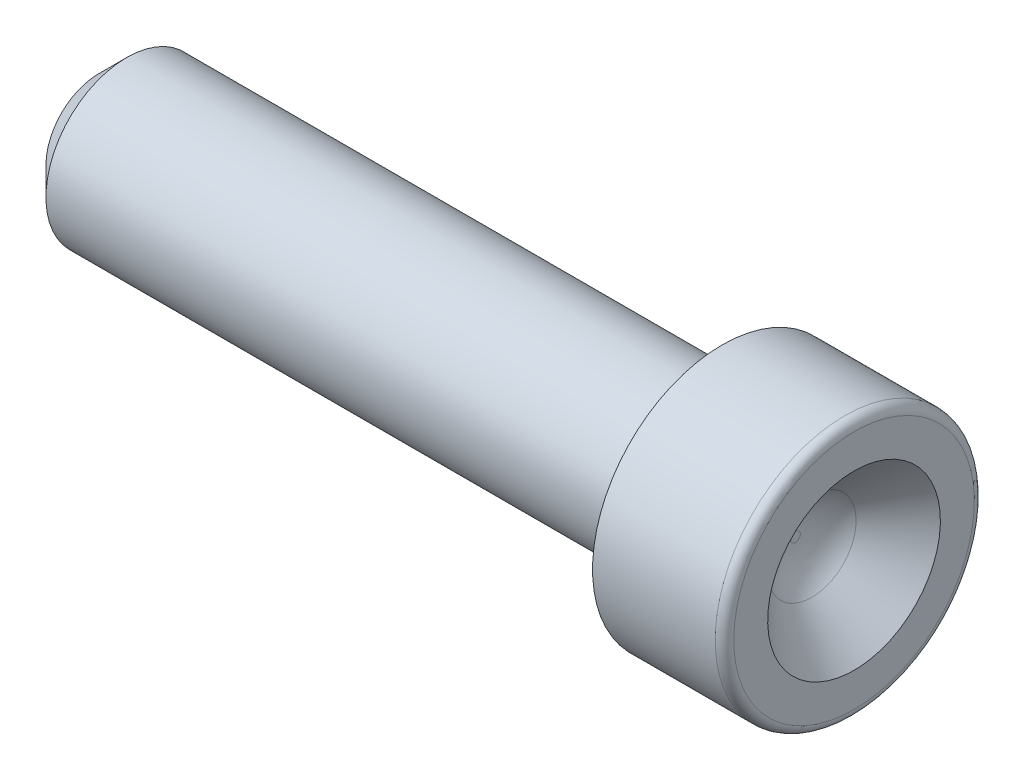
from build123d import *

# Parameters (mm, degrees)
FILLET1_R     = 0.508
CHAMFER1_SIZE = 0.762
FILLET2_R     = 1.524
FILLET3_R     = 0.254


with BuildPart() as part:
    # Sketch1 → Revolve1 (revolve)
    with BuildSketch(Plane.XY, mode=Mode.PRIVATE) as revolve1_sk:
        Polygon((20.65, -1.333), (17.043, -1.333), (17.043, 0), (0, 0), (0, 2.21), (19.05, 2.21), (19.05, 1.448), (20.65, -0.152), align=None)
    revolve(revolve1_sk.sketch.rotate(Axis((19.05, 2.21, 0), (-1, 0, 0)), 180), axis=Axis((19.05, 2.21, 0), (-1, 0, 0)))

    # Fillet1
    fillet1_edges = [part.edges().sort_by_distance(p)[0] for p in [
        (17.043, 0, 0),
    ]]
    fillet(fillet1_edges, radius=FILLET1_R)

    # Chamfer1
    chamfer1_edges = [part.edges().sort_by_distance(p)[0] for p in [
        (0, 0, 0),
    ]]
    chamfer(chamfer1_edges, length=CHAMFER1_SIZE)

    # Fillet2
    fillet2_edges = [part.edges().sort_by_distance(p)[0] for p in [
        (19.05, 1.448, 0),
    ]]
    fillet(fillet2_edges, radius=FILLET2_R)

    # Fillet3
    fillet3_edges = [part.edges().sort_by_distance(p)[0] for p in [
        (20.65, -1.333, 0),
    ]]
    fillet(fillet3_edges, radius=FILLET3_R)


solid = part.part
